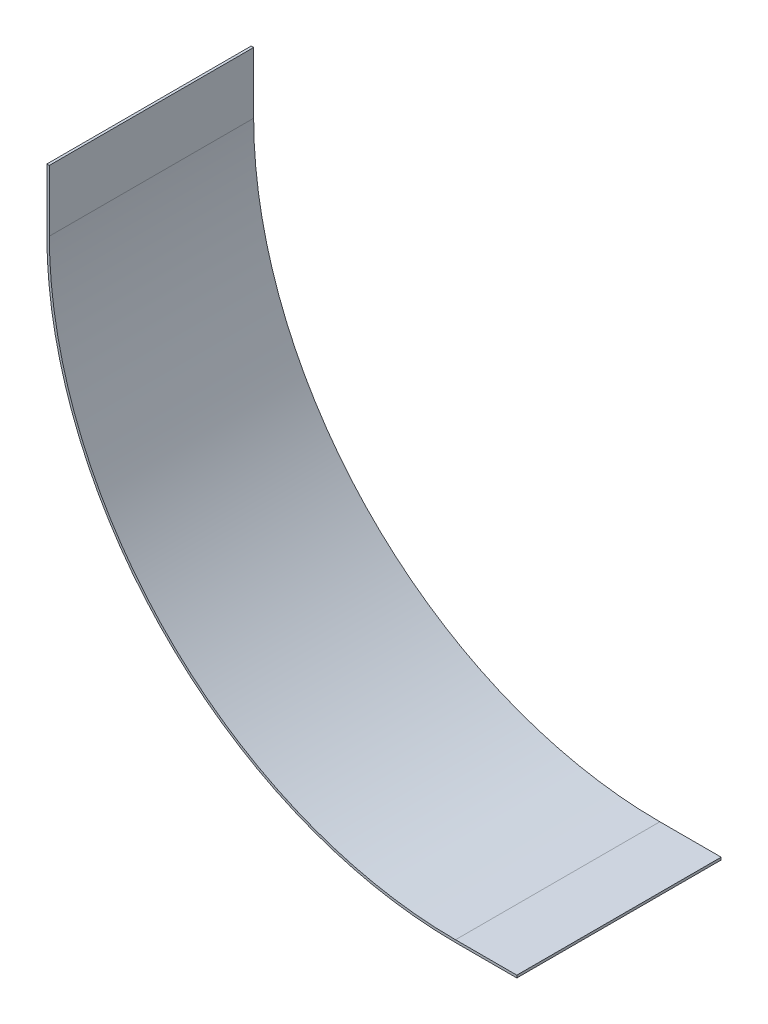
ISO-10303-21;
HEADER;
FILE_DESCRIPTION(('STEP AP214'),'2;1');
FILE_NAME('part.step','',(''),(''),'','','');
FILE_SCHEMA(('AUTOMOTIVE_DESIGN { 1 0 10303 214 1 1 1 1 }'));
ENDSEC;
DATA;
#1=APPLICATION_CONTEXT('core data for automotive mechanical design processes');
#2=APPLICATION_PROTOCOL_DEFINITION('international standard','automotive_design',2000,#1);
#3=PRODUCT_CONTEXT('',#1,'mechanical');
#4=PRODUCT('Part','Part','',(#3));
#5=PRODUCT_RELATED_PRODUCT_CATEGORY('part','',(#4));
#6=PRODUCT_DEFINITION_FORMATION('','',#4);
#7=PRODUCT_DEFINITION_CONTEXT('part definition',#1,'design');
#8=PRODUCT_DEFINITION('design','',#6,#7);
#9=PRODUCT_DEFINITION_SHAPE('','',#8);
#10=(LENGTH_UNIT() NAMED_UNIT(*) SI_UNIT(.MILLI.,.METRE.));
#11=(NAMED_UNIT(*) PLANE_ANGLE_UNIT() SI_UNIT($,.RADIAN.));
#12=(NAMED_UNIT(*) SI_UNIT($,.STERADIAN.) SOLID_ANGLE_UNIT());
#13=UNCERTAINTY_MEASURE_WITH_UNIT(LENGTH_MEASURE(1.E-05),#10,'distance_accuracy_value','');
#14=(GEOMETRIC_REPRESENTATION_CONTEXT(3) GLOBAL_UNCERTAINTY_ASSIGNED_CONTEXT((#13)) GLOBAL_UNIT_ASSIGNED_CONTEXT((#10,
#11,#12)) REPRESENTATION_CONTEXT('',''));
#15=CARTESIAN_POINT('',(0.,0.,0.));
#16=DIRECTION('',(0.,0.,1.));
#17=DIRECTION('',(1.,0.,0.));
#18=AXIS2_PLACEMENT_3D('',#15,#16,#17);
#19=CARTESIAN_POINT('',(1.214,-30.,100.));
#20=DIRECTION('',(-1.,0.,0.));
#21=DIRECTION('',(0.,0.,1.));
#22=AXIS2_PLACEMENT_3D('',#19,#20,#21);
#23=PLANE('',#22);
#24=DIRECTION('',(0.,1.,0.));
#25=VECTOR('',#24,1.);
#26=CARTESIAN_POINT('',(1.214,-30.,0.));
#27=LINE('',#26,#25);
#28=CARTESIAN_POINT('',(1.214,-30.,0.));
#29=VERTEX_POINT('',#28);
#30=CARTESIAN_POINT('',(1.214,0.,0.));
#31=VERTEX_POINT('',#30);
#32=EDGE_CURVE('E128',#29,#31,#27,.T.);
#33=ORIENTED_EDGE('',*,*,#32,.T.);
#34=DIRECTION('',(0.,0.,-1.));
#35=VECTOR('',#34,1.);
#36=CARTESIAN_POINT('',(1.214,0.,100.));
#37=LINE('',#36,#35);
#38=CARTESIAN_POINT('',(1.214,0.,100.));
#39=VERTEX_POINT('',#38);
#40=EDGE_CURVE('E11',#39,#31,#37,.T.);
#41=ORIENTED_EDGE('',*,*,#40,.F.);
#42=DIRECTION('',(0.,1.,0.));
#43=VECTOR('',#42,1.);
#44=CARTESIAN_POINT('',(1.214,-30.,100.));
#45=LINE('',#44,#43);
#46=CARTESIAN_POINT('',(1.214,-30.,100.));
#47=VERTEX_POINT('',#46);
#48=EDGE_CURVE('E86',#47,#39,#45,.T.);
#49=ORIENTED_EDGE('',*,*,#48,.F.);
#50=DIRECTION('',(0.,0.,-1.));
#51=VECTOR('',#50,1.);
#52=CARTESIAN_POINT('',(1.214,-30.,100.));
#53=LINE('',#52,#51);
#54=EDGE_CURVE('E127',#47,#29,#53,.T.);
#55=ORIENTED_EDGE('',*,*,#54,.T.);
#56=EDGE_LOOP('',(#33,#41,#49,#55));
#57=FACE_BOUND('',#56,.T.);
#58=ADVANCED_FACE('F31',(#57),#23,.F.);
#59=CARTESIAN_POINT('',(0.,0.,100.));
#60=DIRECTION('',(0.,1.,0.));
#61=DIRECTION('',(0.,0.,1.));
#62=AXIS2_PLACEMENT_3D('',#59,#60,#61);
#63=PLANE('',#62);
#64=DIRECTION('',(1.,0.,0.));
#65=VECTOR('',#64,1.);
#66=CARTESIAN_POINT('',(0.,0.,0.));
#67=LINE('',#66,#65);
#68=CARTESIAN_POINT('',(0.,0.,0.));
#69=VERTEX_POINT('',#68);
#70=EDGE_CURVE('E131',#69,#31,#67,.T.);
#71=ORIENTED_EDGE('',*,*,#70,.F.);
#72=DIRECTION('',(0.,0.,-1.));
#73=VECTOR('',#72,1.);
#74=CARTESIAN_POINT('',(0.,0.,100.));
#75=LINE('',#74,#73);
#76=CARTESIAN_POINT('',(0.,0.,100.));
#77=VERTEX_POINT('',#76);
#78=EDGE_CURVE('E39',#77,#69,#75,.T.);
#79=ORIENTED_EDGE('',*,*,#78,.F.);
#80=DIRECTION('',(1.,0.,0.));
#81=VECTOR('',#80,1.);
#82=CARTESIAN_POINT('',(0.,0.,100.));
#83=LINE('',#82,#81);
#84=EDGE_CURVE('E170',#77,#39,#83,.T.);
#85=ORIENTED_EDGE('',*,*,#84,.T.);
#86=ORIENTED_EDGE('',*,*,#40,.T.);
#87=EDGE_LOOP('',(#71,#79,#85,#86));
#88=FACE_BOUND('',#87,.T.);
#89=ADVANCED_FACE('F161',(#88),#63,.T.);
#90=CARTESIAN_POINT('',(0.,-30.,100.));
#91=DIRECTION('',(-1.,0.,0.));
#92=DIRECTION('',(0.,0.,1.));
#93=AXIS2_PLACEMENT_3D('',#90,#91,#92);
#94=PLANE('',#93);
#95=DIRECTION('',(0.,1.,0.));
#96=VECTOR('',#95,1.);
#97=CARTESIAN_POINT('',(0.,-30.,0.));
#98=LINE('',#97,#96);
#99=CARTESIAN_POINT('',(0.,-30.,0.));
#100=VERTEX_POINT('',#99);
#101=EDGE_CURVE('E134',#100,#69,#98,.T.);
#102=ORIENTED_EDGE('',*,*,#101,.F.);
#103=DIRECTION('',(0.,0.,-1.));
#104=VECTOR('',#103,1.);
#105=CARTESIAN_POINT('',(0.,-30.,100.));
#106=LINE('',#105,#104);
#107=CARTESIAN_POINT('',(0.,-30.,100.));
#108=VERTEX_POINT('',#107);
#109=EDGE_CURVE('E151',#108,#100,#106,.T.);
#110=ORIENTED_EDGE('',*,*,#109,.F.);
#111=DIRECTION('',(0.,1.,0.));
#112=VECTOR('',#111,1.);
#113=CARTESIAN_POINT('',(0.,-30.,100.));
#114=LINE('',#113,#112);
#115=EDGE_CURVE('E158',#108,#77,#114,.T.);
#116=ORIENTED_EDGE('',*,*,#115,.T.);
#117=ORIENTED_EDGE('',*,*,#78,.T.);
#118=EDGE_LOOP('',(#102,#110,#116,#117));
#119=FACE_BOUND('',#118,.T.);
#120=ADVANCED_FACE('F156',(#119),#94,.T.);
#121=CARTESIAN_POINT('',(199.999999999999,-30.,100.));
#122=DIRECTION('',(0.,0.,-1.));
#123=DIRECTION('',(-1.,0.,0.));
#124=AXIS2_PLACEMENT_3D('',#121,#122,#123);
#125=CYLINDRICAL_SURFACE('',#124,199.999999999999);
#126=CARTESIAN_POINT('',(199.999999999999,-30.,0.));
#127=DIRECTION('',(0.,0.,-1.));
#128=DIRECTION('',(-1.,0.,0.));
#129=AXIS2_PLACEMENT_3D('',#126,#127,#128);
#130=CIRCLE('',#129,199.999999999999);
#131=CARTESIAN_POINT('',(200.,-229.999999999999,0.));
#132=VERTEX_POINT('',#131);
#133=EDGE_CURVE('E137',#132,#100,#130,.T.);
#134=ORIENTED_EDGE('',*,*,#133,.F.);
#135=DIRECTION('',(0.,0.,-1.));
#136=VECTOR('',#135,1.);
#137=CARTESIAN_POINT('',(200.,-229.999999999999,100.));
#138=LINE('',#137,#136);
#139=CARTESIAN_POINT('',(200.,-229.999999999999,100.));
#140=VERTEX_POINT('',#139);
#141=EDGE_CURVE('E149',#140,#132,#138,.T.);
#142=ORIENTED_EDGE('',*,*,#141,.F.);
#143=CARTESIAN_POINT('',(199.999999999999,-30.,100.));
#144=DIRECTION('',(0.,0.,-1.));
#145=DIRECTION('',(-1.,0.,0.));
#146=AXIS2_PLACEMENT_3D('',#143,#144,#145);
#147=CIRCLE('',#146,199.999999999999);
#148=EDGE_CURVE('E122',#140,#108,#147,.T.);
#149=ORIENTED_EDGE('',*,*,#148,.T.);
#150=ORIENTED_EDGE('',*,*,#109,.T.);
#151=EDGE_LOOP('',(#134,#142,#149,#150));
#152=FACE_BOUND('',#151,.T.);
#153=ADVANCED_FACE('F168',(#152),#125,.T.);
#154=CARTESIAN_POINT('',(230.,-229.999999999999,100.));
#155=DIRECTION('',(0.,-1.,0.));
#156=DIRECTION('',(1.,0.,0.));
#157=AXIS2_PLACEMENT_3D('',#154,#155,#156);
#158=PLANE('',#157);
#159=DIRECTION('',(-1.,0.,0.));
#160=VECTOR('',#159,1.);
#161=CARTESIAN_POINT('',(230.,-229.999999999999,0.));
#162=LINE('',#161,#160);
#163=CARTESIAN_POINT('',(230.,-229.999999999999,0.));
#164=VERTEX_POINT('',#163);
#165=EDGE_CURVE('E140',#164,#132,#162,.T.);
#166=ORIENTED_EDGE('',*,*,#165,.F.);
#167=DIRECTION('',(0.,0.,-1.));
#168=VECTOR('',#167,1.);
#169=CARTESIAN_POINT('',(230.,-229.999999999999,100.));
#170=LINE('',#169,#168);
#171=CARTESIAN_POINT('',(230.,-229.999999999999,100.));
#172=VERTEX_POINT('',#171);
#173=EDGE_CURVE('E110',#172,#164,#170,.T.);
#174=ORIENTED_EDGE('',*,*,#173,.F.);
#175=DIRECTION('',(-1.,0.,0.));
#176=VECTOR('',#175,1.);
#177=CARTESIAN_POINT('',(230.,-229.999999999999,100.));
#178=LINE('',#177,#176);
#179=EDGE_CURVE('E120',#172,#140,#178,.T.);
#180=ORIENTED_EDGE('',*,*,#179,.T.);
#181=ORIENTED_EDGE('',*,*,#141,.T.);
#182=EDGE_LOOP('',(#166,#174,#180,#181));
#183=FACE_BOUND('',#182,.T.);
#184=ADVANCED_FACE('F175',(#183),#158,.T.);
#185=CARTESIAN_POINT('',(230.,-228.785999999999,100.));
#186=DIRECTION('',(1.,0.,0.));
#187=DIRECTION('',(0.,0.,-1.));
#188=AXIS2_PLACEMENT_3D('',#185,#186,#187);
#189=PLANE('',#188);
#190=DIRECTION('',(0.,-1.,0.));
#191=VECTOR('',#190,1.);
#192=CARTESIAN_POINT('',(230.,-228.785999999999,0.));
#193=LINE('',#192,#191);
#194=CARTESIAN_POINT('',(230.,-228.785999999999,0.));
#195=VERTEX_POINT('',#194);
#196=EDGE_CURVE('E109',#195,#164,#193,.T.);
#197=ORIENTED_EDGE('',*,*,#196,.F.);
#198=DIRECTION('',(0.,0.,-1.));
#199=VECTOR('',#198,1.);
#200=CARTESIAN_POINT('',(230.,-228.785999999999,100.));
#201=LINE('',#200,#199);
#202=CARTESIAN_POINT('',(230.,-228.785999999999,100.));
#203=VERTEX_POINT('',#202);
#204=EDGE_CURVE('E103',#203,#195,#201,.T.);
#205=ORIENTED_EDGE('',*,*,#204,.F.);
#206=DIRECTION('',(0.,-1.,0.));
#207=VECTOR('',#206,1.);
#208=CARTESIAN_POINT('',(230.,-228.785999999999,100.));
#209=LINE('',#208,#207);
#210=EDGE_CURVE('E107',#203,#172,#209,.T.);
#211=ORIENTED_EDGE('',*,*,#210,.T.);
#212=ORIENTED_EDGE('',*,*,#173,.T.);
#213=EDGE_LOOP('',(#197,#205,#211,#212));
#214=FACE_BOUND('',#213,.T.);
#215=ADVANCED_FACE('F105',(#214),#189,.T.);
#216=CARTESIAN_POINT('',(230.,-228.785999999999,100.));
#217=DIRECTION('',(0.,-1.,0.));
#218=DIRECTION('',(1.,0.,0.));
#219=AXIS2_PLACEMENT_3D('',#216,#217,#218);
#220=PLANE('',#219);
#221=DIRECTION('',(-1.,0.,0.));
#222=VECTOR('',#221,1.);
#223=CARTESIAN_POINT('',(230.,-228.785999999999,0.));
#224=LINE('',#223,#222);
#225=CARTESIAN_POINT('',(200.,-228.785999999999,0.));
#226=VERTEX_POINT('',#225);
#227=EDGE_CURVE('E74',#195,#226,#224,.T.);
#228=ORIENTED_EDGE('',*,*,#227,.T.);
#229=DIRECTION('',(0.,0.,-1.));
#230=VECTOR('',#229,1.);
#231=CARTESIAN_POINT('',(200.,-228.785999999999,100.));
#232=LINE('',#231,#230);
#233=CARTESIAN_POINT('',(200.,-228.785999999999,100.));
#234=VERTEX_POINT('',#233);
#235=EDGE_CURVE('E111',#234,#226,#232,.T.);
#236=ORIENTED_EDGE('',*,*,#235,.F.);
#237=DIRECTION('',(-1.,0.,0.));
#238=VECTOR('',#237,1.);
#239=CARTESIAN_POINT('',(230.,-228.785999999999,100.));
#240=LINE('',#239,#238);
#241=EDGE_CURVE('E113',#203,#234,#240,.T.);
#242=ORIENTED_EDGE('',*,*,#241,.F.);
#243=ORIENTED_EDGE('',*,*,#204,.T.);
#244=EDGE_LOOP('',(#228,#236,#242,#243));
#245=FACE_BOUND('',#244,.T.);
#246=ADVANCED_FACE('F114',(#245),#220,.F.);
#247=CARTESIAN_POINT('',(199.999999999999,-30.,100.));
#248=DIRECTION('',(0.,0.,-1.));
#249=DIRECTION('',(-1.,0.,0.));
#250=AXIS2_PLACEMENT_3D('',#247,#248,#249);
#251=CYLINDRICAL_SURFACE('',#250,198.785999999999);
#252=CARTESIAN_POINT('',(199.999999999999,-30.,0.));
#253=DIRECTION('',(0.,0.,1.));
#254=DIRECTION('',(1.,0.,0.));
#255=AXIS2_PLACEMENT_3D('',#252,#253,#254);
#256=CIRCLE('',#255,198.785999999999);
#257=EDGE_CURVE('E80',#226,#29,#256,.F.);
#258=ORIENTED_EDGE('',*,*,#257,.T.);
#259=ORIENTED_EDGE('',*,*,#54,.F.);
#260=CARTESIAN_POINT('',(199.999999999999,-30.,100.));
#261=DIRECTION('',(0.,0.,1.));
#262=DIRECTION('',(1.,0.,0.));
#263=AXIS2_PLACEMENT_3D('',#260,#261,#262);
#264=CIRCLE('',#263,198.785999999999);
#265=EDGE_CURVE('E47',#234,#47,#264,.F.);
#266=ORIENTED_EDGE('',*,*,#265,.F.);
#267=ORIENTED_EDGE('',*,*,#235,.T.);
#268=EDGE_LOOP('',(#258,#259,#266,#267));
#269=FACE_BOUND('',#268,.T.);
#270=ADVANCED_FACE('F177',(#269),#251,.F.);
#271=CARTESIAN_POINT('',(199.999999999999,-30.,100.));
#272=DIRECTION('',(0.,0.,-1.));
#273=DIRECTION('',(-1.,0.,0.));
#274=AXIS2_PLACEMENT_3D('',#271,#272,#273);
#275=PLANE('',#274);
#276=ORIENTED_EDGE('',*,*,#48,.T.);
#277=ORIENTED_EDGE('',*,*,#84,.F.);
#278=ORIENTED_EDGE('',*,*,#115,.F.);
#279=ORIENTED_EDGE('',*,*,#148,.F.);
#280=ORIENTED_EDGE('',*,*,#179,.F.);
#281=ORIENTED_EDGE('',*,*,#210,.F.);
#282=ORIENTED_EDGE('',*,*,#241,.T.);
#283=ORIENTED_EDGE('',*,*,#265,.T.);
#284=EDGE_LOOP('',(#276,#277,#278,#279,#280,#281,#282,#283));
#285=FACE_BOUND('',#284,.T.);
#286=ADVANCED_FACE('F117',(#285),#275,.F.);
#287=CARTESIAN_POINT('',(199.999999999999,-30.,0.));
#288=DIRECTION('',(0.,0.,-1.));
#289=DIRECTION('',(-1.,0.,0.));
#290=AXIS2_PLACEMENT_3D('',#287,#288,#289);
#291=PLANE('',#290);
#292=ORIENTED_EDGE('',*,*,#32,.F.);
#293=ORIENTED_EDGE('',*,*,#257,.F.);
#294=ORIENTED_EDGE('',*,*,#227,.F.);
#295=ORIENTED_EDGE('',*,*,#196,.T.);
#296=ORIENTED_EDGE('',*,*,#165,.T.);
#297=ORIENTED_EDGE('',*,*,#133,.T.);
#298=ORIENTED_EDGE('',*,*,#101,.T.);
#299=ORIENTED_EDGE('',*,*,#70,.T.);
#300=EDGE_LOOP('',(#292,#293,#294,#295,#296,#297,#298,#299));
#301=FACE_BOUND('',#300,.T.);
#302=ADVANCED_FACE('F164',(#301),#291,.T.);
#303=CLOSED_SHELL('',(#58,#89,#120,#153,#184,#215,#246,#270,#286,#302));
#304=MANIFOLD_SOLID_BREP('B2',#303);
#305=ADVANCED_BREP_SHAPE_REPRESENTATION('',(#18,#304),#14);
#306=SHAPE_DEFINITION_REPRESENTATION(#9,#305);
ENDSEC;
END-ISO-10303-21;
